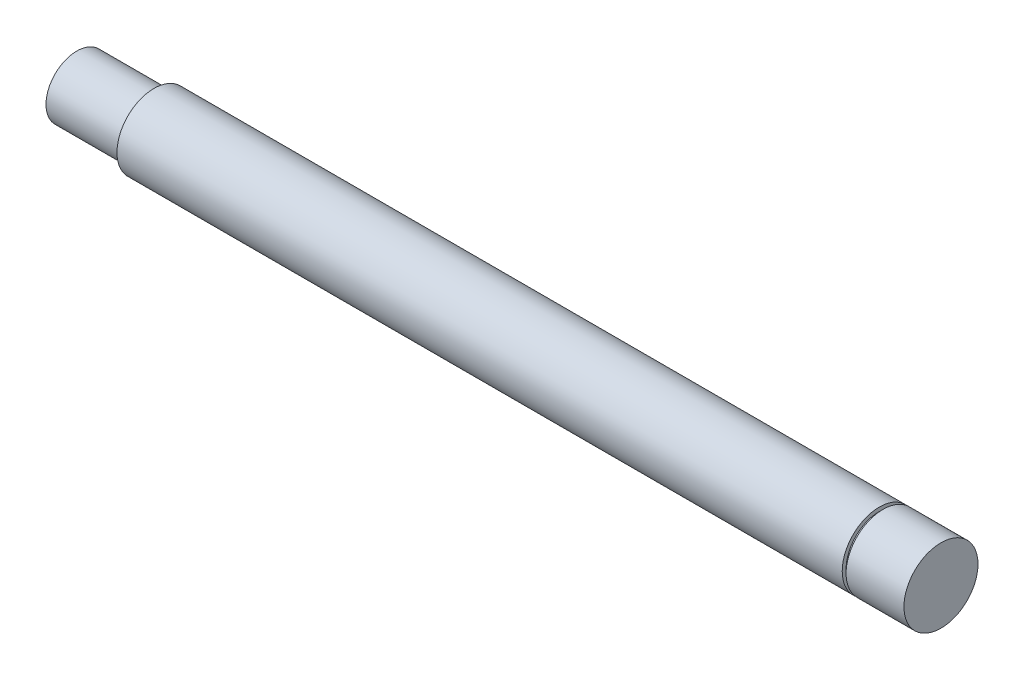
ISO-10303-21;
HEADER;
FILE_DESCRIPTION(('STEP AP214'),'2;1');
FILE_NAME('part.step','',(''),(''),'','','');
FILE_SCHEMA(('AUTOMOTIVE_DESIGN { 1 0 10303 214 1 1 1 1 }'));
ENDSEC;
DATA;
#1=APPLICATION_CONTEXT('core data for automotive mechanical design processes');
#2=APPLICATION_PROTOCOL_DEFINITION('international standard','automotive_design',2000,#1);
#3=PRODUCT_CONTEXT('',#1,'mechanical');
#4=PRODUCT('Part','Part','',(#3));
#5=PRODUCT_RELATED_PRODUCT_CATEGORY('part','',(#4));
#6=PRODUCT_DEFINITION_FORMATION('','',#4);
#7=PRODUCT_DEFINITION_CONTEXT('part definition',#1,'design');
#8=PRODUCT_DEFINITION('design','',#6,#7);
#9=PRODUCT_DEFINITION_SHAPE('','',#8);
#10=(LENGTH_UNIT() NAMED_UNIT(*) SI_UNIT(.MILLI.,.METRE.));
#11=(NAMED_UNIT(*) PLANE_ANGLE_UNIT() SI_UNIT($,.RADIAN.));
#12=(NAMED_UNIT(*) SI_UNIT($,.STERADIAN.) SOLID_ANGLE_UNIT());
#13=UNCERTAINTY_MEASURE_WITH_UNIT(LENGTH_MEASURE(1.E-05),#10,'distance_accuracy_value','');
#14=(GEOMETRIC_REPRESENTATION_CONTEXT(3) GLOBAL_UNCERTAINTY_ASSIGNED_CONTEXT((#13)) GLOBAL_UNIT_ASSIGNED_CONTEXT((#10,
#11,#12)) REPRESENTATION_CONTEXT('',''));
#15=CARTESIAN_POINT('',(0.,0.,0.));
#16=DIRECTION('',(0.,0.,1.));
#17=DIRECTION('',(1.,0.,0.));
#18=AXIS2_PLACEMENT_3D('',#15,#16,#17);
#19=CARTESIAN_POINT('',(177.8,0.,0.));
#20=DIRECTION('',(-1.,0.,0.));
#21=DIRECTION('',(0.,0.,1.));
#22=AXIS2_PLACEMENT_3D('',#19,#20,#21);
#23=CYLINDRICAL_SURFACE('',#22,7.62);
#24=CARTESIAN_POINT('',(165.1,0.,0.));
#25=DIRECTION('',(1.,0.,0.));
#26=DIRECTION('',(0.,0.,-1.));
#27=AXIS2_PLACEMENT_3D('',#24,#25,#26);
#28=CIRCLE('',#27,7.62);
#29=CARTESIAN_POINT('',(165.1,0.,-7.62));
#30=VERTEX_POINT('',#29);
#31=EDGE_CURVE('E46',#30,#30,#28,.T.);
#32=ORIENTED_EDGE('',*,*,#31,.F.);
#33=EDGE_LOOP('',(#32));
#34=FACE_BOUND('',#33,.T.);
#35=CARTESIAN_POINT('',(15.875,0.,0.));
#36=DIRECTION('',(-1.,0.,0.));
#37=DIRECTION('',(0.,0.,1.));
#38=AXIS2_PLACEMENT_3D('',#35,#36,#37);
#39=CIRCLE('',#38,7.62);
#40=CARTESIAN_POINT('',(15.875,0.,7.62));
#41=VERTEX_POINT('',#40);
#42=EDGE_CURVE('E58',#41,#41,#39,.T.);
#43=ORIENTED_EDGE('',*,*,#42,.F.);
#44=EDGE_LOOP('',(#43));
#45=FACE_BOUND('',#44,.T.);
#46=ADVANCED_FACE('F39',(#34,#45),#23,.T.);
#47=CARTESIAN_POINT('',(165.1,0.,0.));
#48=DIRECTION('',(1.,0.,0.));
#49=DIRECTION('',(0.,0.,-1.));
#50=AXIS2_PLACEMENT_3D('',#47,#48,#49);
#51=PLANE('',#50);
#52=CARTESIAN_POINT('',(165.1,0.,0.));
#53=DIRECTION('',(1.,0.,0.));
#54=DIRECTION('',(0.,0.,-1.));
#55=AXIS2_PLACEMENT_3D('',#52,#53,#54);
#56=CIRCLE('',#55,6.82625);
#57=CARTESIAN_POINT('',(165.1,0.,-6.82625));
#58=VERTEX_POINT('',#57);
#59=EDGE_CURVE('E54',#58,#58,#56,.T.);
#60=ORIENTED_EDGE('',*,*,#59,.F.);
#61=EDGE_LOOP('',(#60));
#62=FACE_BOUND('',#61,.T.);
#63=ORIENTED_EDGE('',*,*,#31,.T.);
#64=EDGE_LOOP('',(#63));
#65=FACE_BOUND('',#64,.T.);
#66=ADVANCED_FACE('F84',(#62,#65),#51,.T.);
#67=CARTESIAN_POINT('',(165.89375,0.,0.));
#68=DIRECTION('',(1.,0.,0.));
#69=DIRECTION('',(0.,0.,-1.));
#70=AXIS2_PLACEMENT_3D('',#67,#68,#69);
#71=PLANE('',#70);
#72=CARTESIAN_POINT('',(165.89375,0.,0.));
#73=DIRECTION('',(1.,0.,0.));
#74=DIRECTION('',(0.,0.,-1.));
#75=AXIS2_PLACEMENT_3D('',#72,#73,#74);
#76=CIRCLE('',#75,6.82625);
#77=CARTESIAN_POINT('',(165.89375,0.,-6.82625));
#78=VERTEX_POINT('',#77);
#79=EDGE_CURVE('E60',#78,#78,#76,.T.);
#80=ORIENTED_EDGE('',*,*,#79,.T.);
#81=EDGE_LOOP('',(#80));
#82=FACE_BOUND('',#81,.T.);
#83=CARTESIAN_POINT('',(165.89375,0.,0.));
#84=DIRECTION('',(1.,0.,0.));
#85=DIRECTION('',(0.,0.,-1.));
#86=AXIS2_PLACEMENT_3D('',#83,#84,#85);
#87=CIRCLE('',#86,7.62);
#88=CARTESIAN_POINT('',(165.89375,0.,-7.62));
#89=VERTEX_POINT('',#88);
#90=EDGE_CURVE('E49',#89,#89,#87,.T.);
#91=ORIENTED_EDGE('',*,*,#90,.F.);
#92=EDGE_LOOP('',(#91));
#93=FACE_BOUND('',#92,.T.);
#94=ADVANCED_FACE('F87',(#82,#93),#71,.F.);
#95=CARTESIAN_POINT('',(165.1,0.,0.));
#96=DIRECTION('',(1.,0.,0.));
#97=DIRECTION('',(0.,0.,-1.));
#98=AXIS2_PLACEMENT_3D('',#95,#96,#97);
#99=CYLINDRICAL_SURFACE('',#98,6.82625);
#100=ORIENTED_EDGE('',*,*,#59,.T.);
#101=EDGE_LOOP('',(#100));
#102=FACE_BOUND('',#101,.T.);
#103=ORIENTED_EDGE('',*,*,#79,.F.);
#104=EDGE_LOOP('',(#103));
#105=FACE_BOUND('',#104,.T.);
#106=ADVANCED_FACE('F100',(#102,#105),#99,.T.);
#107=CARTESIAN_POINT('',(177.8,0.,0.));
#108=DIRECTION('',(1.,0.,0.));
#109=DIRECTION('',(0.,0.,-1.));
#110=AXIS2_PLACEMENT_3D('',#107,#108,#109);
#111=PLANE('',#110);
#112=CARTESIAN_POINT('',(177.8,0.,0.));
#113=DIRECTION('',(1.,0.,0.));
#114=DIRECTION('',(0.,0.,-1.));
#115=AXIS2_PLACEMENT_3D('',#112,#113,#114);
#116=CIRCLE('',#115,7.62);
#117=CARTESIAN_POINT('',(177.8,0.,-7.62));
#118=VERTEX_POINT('',#117);
#119=EDGE_CURVE('E10',#118,#118,#116,.T.);
#120=ORIENTED_EDGE('',*,*,#119,.T.);
#121=EDGE_LOOP('',(#120));
#122=FACE_BOUND('',#121,.T.);
#123=ADVANCED_FACE('F93',(#122),#111,.T.);
#124=ORIENTED_EDGE('',*,*,#90,.T.);
#125=EDGE_LOOP('',(#124));
#126=FACE_BOUND('',#125,.T.);
#127=ORIENTED_EDGE('',*,*,#119,.F.);
#128=EDGE_LOOP('',(#127));
#129=FACE_BOUND('',#128,.T.);
#130=ADVANCED_FACE('F41',(#126,#129),#23,.T.);
#131=CARTESIAN_POINT('',(15.875,0.,0.));
#132=DIRECTION('',(-1.,0.,0.));
#133=DIRECTION('',(0.,0.,1.));
#134=AXIS2_PLACEMENT_3D('',#131,#132,#133);
#135=PLANE('',#134);
#136=CARTESIAN_POINT('',(15.875,0.,0.));
#137=DIRECTION('',(-1.,0.,0.));
#138=DIRECTION('',(0.,0.,1.));
#139=AXIS2_PLACEMENT_3D('',#136,#137,#138);
#140=CIRCLE('',#139,6.35);
#141=CARTESIAN_POINT('',(15.875,0.,6.35));
#142=VERTEX_POINT('',#141);
#143=EDGE_CURVE('E61',#142,#142,#140,.T.);
#144=ORIENTED_EDGE('',*,*,#143,.F.);
#145=EDGE_LOOP('',(#144));
#146=FACE_BOUND('',#145,.T.);
#147=ORIENTED_EDGE('',*,*,#42,.T.);
#148=EDGE_LOOP('',(#147));
#149=FACE_BOUND('',#148,.T.);
#150=ADVANCED_FACE('F73',(#146,#149),#135,.T.);
#151=CARTESIAN_POINT('',(15.875,0.,0.));
#152=DIRECTION('',(-1.,0.,0.));
#153=DIRECTION('',(0.,0.,1.));
#154=AXIS2_PLACEMENT_3D('',#151,#152,#153);
#155=CYLINDRICAL_SURFACE('',#154,6.35);
#156=ORIENTED_EDGE('',*,*,#143,.T.);
#157=EDGE_LOOP('',(#156));
#158=FACE_BOUND('',#157,.T.);
#159=CARTESIAN_POINT('',(0.,0.,0.));
#160=DIRECTION('',(-1.,0.,0.));
#161=DIRECTION('',(0.,0.,1.));
#162=AXIS2_PLACEMENT_3D('',#159,#160,#161);
#163=CIRCLE('',#162,6.35);
#164=CARTESIAN_POINT('',(0.,0.,6.35));
#165=VERTEX_POINT('',#164);
#166=EDGE_CURVE('E66',#165,#165,#163,.T.);
#167=ORIENTED_EDGE('',*,*,#166,.F.);
#168=EDGE_LOOP('',(#167));
#169=FACE_BOUND('',#168,.T.);
#170=ADVANCED_FACE('F75',(#158,#169),#155,.T.);
#171=CARTESIAN_POINT('',(0.,0.,0.));
#172=DIRECTION('',(1.,0.,0.));
#173=DIRECTION('',(0.,0.,-1.));
#174=AXIS2_PLACEMENT_3D('',#171,#172,#173);
#175=PLANE('',#174);
#176=ORIENTED_EDGE('',*,*,#166,.T.);
#177=EDGE_LOOP('',(#176));
#178=FACE_BOUND('',#177,.T.);
#179=ADVANCED_FACE('F109',(#178),#175,.F.);
#180=CLOSED_SHELL('',(#46,#66,#94,#106,#123,#130,#150,#170,#179));
#181=MANIFOLD_SOLID_BREP('B2',#180);
#182=ADVANCED_BREP_SHAPE_REPRESENTATION('',(#18,#181),#14);
#183=SHAPE_DEFINITION_REPRESENTATION(#9,#182);
ENDSEC;
END-ISO-10303-21;
